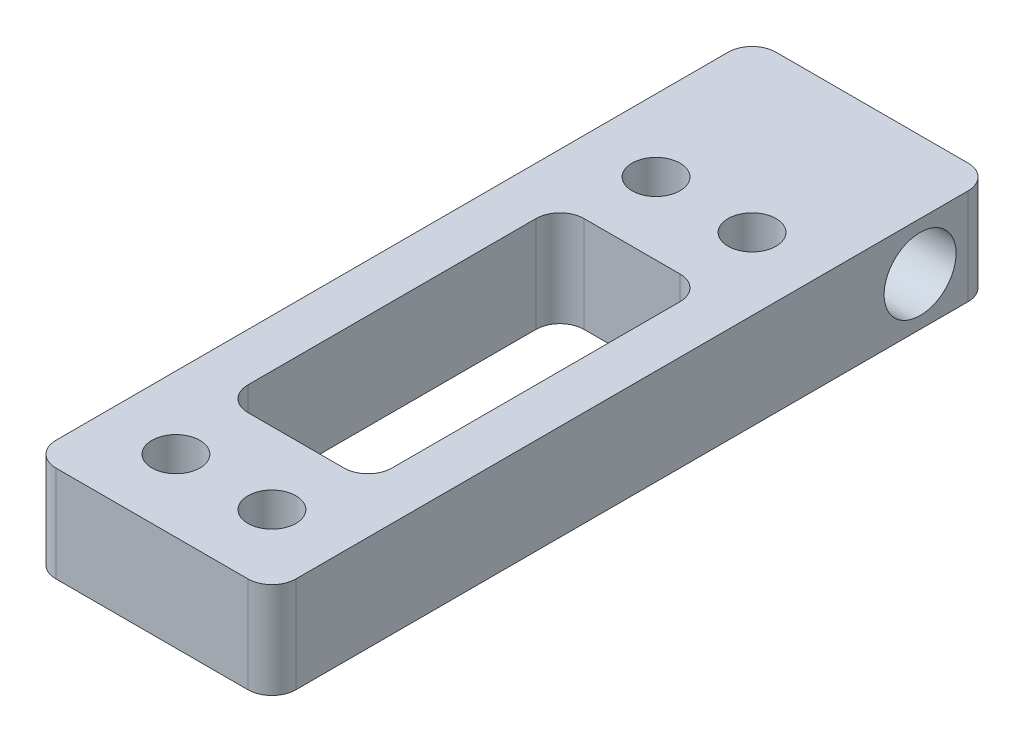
from build123d import *

# Parameters (mm, degrees)
SKETCH1_W           = 95.25
SKETCH1_H           = 12.7
SKETCH1_R           = 4.7625
BOSS_EXTRUDE1_DEPTH = 31.75
SKETCH2_R           = 3.175
SKETCH2_W           = 19.05
SKETCH2_H           = 44.45
CUT_EXTRUDE1_DEPTH  = 93.293705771
FILLET1_R           = 3.175


with BuildPart() as part:
    # Sketch1 → Boss-Extrude1 (new body)
    with BuildSketch(Plane(origin=(0, 0, 0), x_dir=(0, 0, -1), z_dir=(1, 0, 0))):
        with Locations((-38.1, 0)):
            Rectangle(SKETCH1_W, SKETCH1_H)
        Circle(SKETCH1_R, mode=Mode.SUBTRACT)
    extrude(amount=BOSS_EXTRUDE1_DEPTH)

    # Sketch2 → Cut-Extrude1 (cut, through all)
    with BuildSketch(Plane(origin=(0, 6.35, 0), x_dir=(1, 0, 0), z_dir=(0, 1, 0))):
        with Locations(Location((9.525, -12.7, 0), (0, 0, 270))):
            Circle(SKETCH2_R)
        with Locations(Location((22.225, -12.7, 0), (0, 0, 270))):
            Circle(SKETCH2_R)
        with Locations(Location((9.525, -76.2, 0), (0, 0, 270))):
            Circle(SKETCH2_R)
        with Locations(Location((22.225, -76.2, 0), (0, 0, 270))):
            Circle(SKETCH2_R)
        with Locations((15.875, -44.45)):
            Rectangle(SKETCH2_W, SKETCH2_H)
    extrude(amount=-CUT_EXTRUDE1_DEPTH, mode=Mode.SUBTRACT)

    # Fillet1
    fillet1_edges = [part.edges().sort_by_distance(p)[0] for p in [
        (31.75, 0, 85.725),
        (6.35, 0, 66.675),
        (6.35, 0, 22.225),
        (25.4, 0, 22.225),
        (25.4, 0, 66.675),
        (31.75, 0, -9.525),
        (0, 0, 85.725),
        (0, 0, -9.525),
    ]]
    fillet(fillet1_edges, radius=FILLET1_R)


solid = part.part
